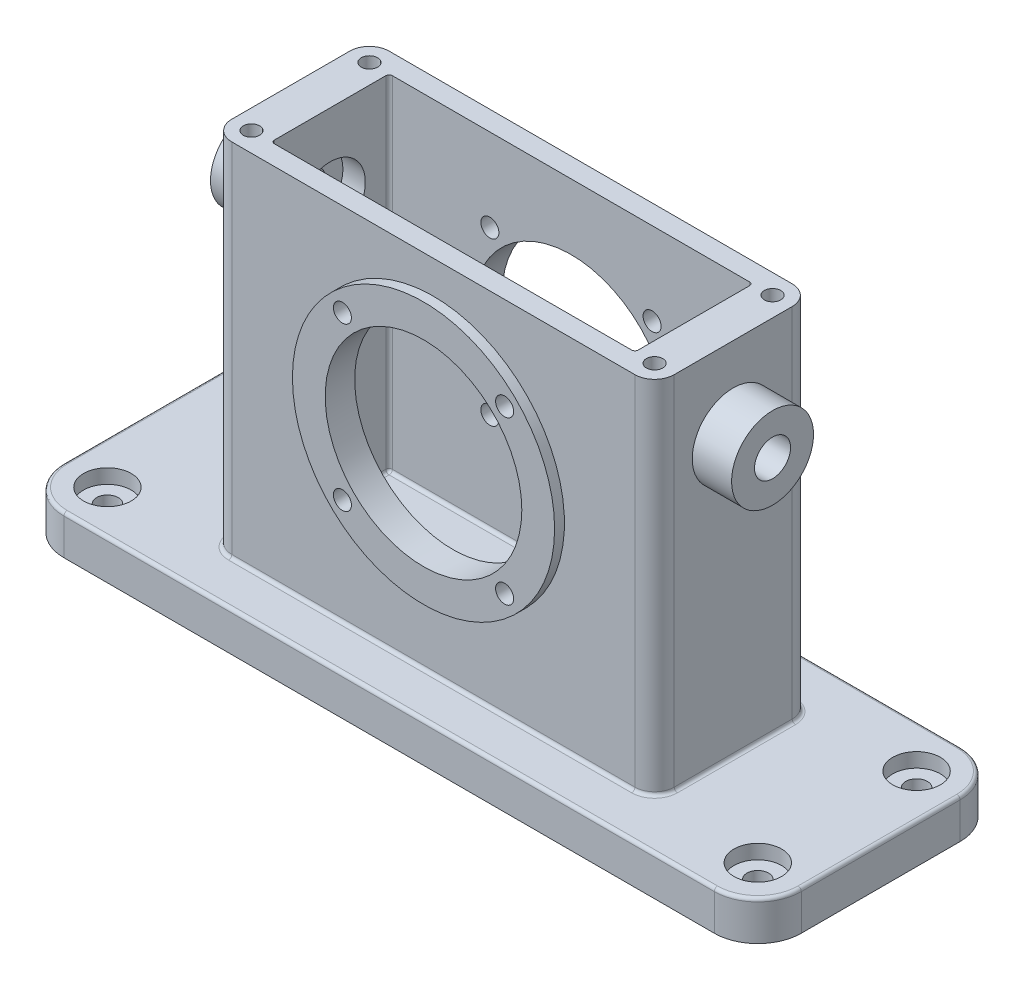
from build123d import *

# Parameters (mm, degrees)
SKETCH1_W                                = 112.5
SKETCH1_H                                = 75
PLATE_DEPTH                              = 12
SKETCH2_W                                = 67.5
SKETCH2_H                                = 48
HSG_DEPTH                                = 110
SKETCH3_R                                = 12.5
SM_CIR_BOSS_DEPTH                        = 12
SKETCH4_W                                = 55.5
SKETCH4_H                                = 36
INNER_CUT_DEPTH                          = 105
CBORE_FOR_M10_HEX_HEAD_BOLT1_D           = 11
CBORE_FOR_M10_HEX_HEAD_BOLT1_CBORE_D     = 21.48
CBORE_FOR_M10_HEX_HEAD_BOLT1_CBORE_DEPTH = 6.85
FILLET1_R                                = 13.275
FILLET2_R                                = 1
FILLET3_R                                = 6
FILLET4_R                                = 1
FILLET5_R                                = 1
FILLET6_R                                = 1
F_5_0_5_DIAMETER_HOLE1_D                 = 5
F_5_0_5_DIAMETER_HOLE1_DEPTH             = 10
F_5_0_5_DIAMETER_HOLE1_TIP               = 1.502151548
CBORE_FOR_M6_HEX_HEAD_BOLT1_D            = 6.6
CBORE_FOR_M6_HEX_HEAD_BOLT1_CBORE_D      = 14.55
CBORE_FOR_M6_HEX_HEAD_BOLT1_CBORE_DEPTH  = 4.38
SKETCH11_R                               = 40
LG_CIR_BOSS_DEPTH                        = 3
SKETCH12_R                               = 30
LG_THRU_HOLE_DEPTH                       = 179.046342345
F_5_5_5_5_DIAMETER_HOLE1_D               = 5.5


with BuildPart() as part:
    # Sketch1 → Plate (new body)
    with BuildSketch(Plane(origin=(0, 0, 0), x_dir=(1, 0, 0), z_dir=(0, 1, 0))):
        with Locations((56.25, 0)):
            Rectangle(SKETCH1_W, SKETCH1_H)
    extrude(amount=PLATE_DEPTH)

    # Sketch2 → Hsg (add)
    with BuildSketch(Plane(origin=(0, 12, 0), x_dir=(1, 0, 0), z_dir=(0, 1, 0))):
        with Locations((33.75, 0)):
            Rectangle(SKETCH2_W, SKETCH2_H)
    extrude(amount=HSG_DEPTH)

    # Sketch3 → Sm Cir Boss (add)
    with BuildSketch(Plane(origin=(67.5, 0, 0), x_dir=(0, 0, -1), z_dir=(1, 0, 0))):
        with Locations(Location((0, 97, 0), (0, 0, 180))):
            Circle(SKETCH3_R)
    extrude(amount=SM_CIR_BOSS_DEPTH)

    # Sketch4 → Inner Cut (cut)
    with BuildSketch(Plane(origin=(0, 122, 0), x_dir=(1, 0, 0), z_dir=(0, 1, 0))):
        with Locations((27.75, 0)):
            Rectangle(SKETCH4_W, SKETCH4_H)
    extrude(amount=-INNER_CUT_DEPTH, mode=Mode.SUBTRACT)

    # CBORE for M10 Hex Head Bolt1 (through all)
    with Locations(Plane.ZY.offset(-55.5)):
        with Locations((0, 97)):
            CounterBoreHole(CBORE_FOR_M10_HEX_HEAD_BOLT1_D / 2, CBORE_FOR_M10_HEX_HEAD_BOLT1_CBORE_D / 2, CBORE_FOR_M10_HEX_HEAD_BOLT1_CBORE_DEPTH)

    # Fillet1
    fillet1_edges = [part.edges().sort_by_distance(p)[0] for p in [
        (112.5, 6, 37.5),
        (112.5, 6, -37.5),
    ]]
    fillet(fillet1_edges, radius=FILLET1_R)

    # Fillet2
    fillet2_edges = [part.edges().sort_by_distance(p)[0] for p in [
        (49.6125, 12, -37.5),
        (108.61184252, 12, -33.61184252),
        (112.5, 12, 0),
        (108.61184252, 12, 33.61184252),
        (49.6125, 12, 37.5),
    ]]
    fillet(fillet2_edges, radius=FILLET2_R)

    # Fillet3
    fillet3_edges = [part.edges().sort_by_distance(p)[0] for p in [
        (67.5, 67, -24),
        (67.5, 67, 24),
    ]]
    fillet(fillet3_edges, radius=FILLET3_R)

    # Fillet4
    fillet4_edges = [part.edges().sort_by_distance(p)[0] for p in [
        (30.75, 12, -24),
        (65.742640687, 12, -22.242640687),
        (67.5, 12, 0),
        (65.742640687, 12, 22.242640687),
        (30.75, 12, 24),
    ]]
    fillet(fillet4_edges, radius=FILLET4_R)

    # Fillet5
    fillet5_edges = [part.edges().sort_by_distance(p)[0] for p in [
        (55.5, 69.5, 18),
        (55.5, 69.5, -18),
    ]]
    fillet(fillet5_edges, radius=FILLET5_R)

    # Fillet6
    fillet6_edges = [part.edges().sort_by_distance(p)[0] for p in [
        (55.5, 17, 0),
        (27.25, 17, -18),
        (55.207106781, 17, -17.707106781),
        (55.207106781, 17, 17.707106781),
        (27.25, 17, 18),
    ]]
    fillet(fillet6_edges, radius=FILLET6_R)

    # 5.0 _5_ Diameter Hole1
    with Locations(Plane(origin=(0, 122, 0), x_dir=(1, 0, 0), z_dir=(0, 1, 0))):
        with Locations((61.5, -18), (61.5, 18)):
            Hole(F_5_0_5_DIAMETER_HOLE1_D / 2, depth=F_5_0_5_DIAMETER_HOLE1_DEPTH)
            with Locations((0, 0, -(F_5_0_5_DIAMETER_HOLE1_DEPTH + F_5_0_5_DIAMETER_HOLE1_TIP / 2))):  # 118° drill point
                Cone(0, F_5_0_5_DIAMETER_HOLE1_D / 2, F_5_0_5_DIAMETER_HOLE1_TIP, mode=Mode.SUBTRACT)

    # CBORE for M6 Hex Head Bolt1 (through all)
    with Locations(Plane(origin=(0, 12, 0), x_dir=(1, 0, 0), z_dir=(0, 1, 0))):
        with Locations((99.225, -24.225), (99.225, 24.225)):
            CounterBoreHole(CBORE_FOR_M6_HEX_HEAD_BOLT1_D / 2, CBORE_FOR_M6_HEX_HEAD_BOLT1_CBORE_D / 2, CBORE_FOR_M6_HEX_HEAD_BOLT1_CBORE_DEPTH)

    # Mirror1: part across plane


with BuildPart() as part_1:
    add(part.part)
    add(part.part.mirror(Plane(origin=(0, 12, -37.5), x_dir=(0, 0, 1), z_dir=(1, 0, 0))))

    # Sketch11 → Lg Cir Boss (add)
    with BuildSketch(Plane.XY.offset(24)):
        with Locations(Location((0, 72, 0), (0, 0, 180))):
            Circle(SKETCH11_R)
    lg_cir_boss = extrude(amount=LG_CIR_BOSS_DEPTH)

    # Mirror2: Lg Cir Boss across plane
    add(lg_cir_boss.mirror(Plane.XY))

    # Sketch12 → Lg Thru Hole (cut, through all)
    with BuildSketch(Plane.XY.offset(27)):
        with Locations(Location((0, 72, 0), (0, 0, 180))):
            Circle(SKETCH12_R)
    extrude(amount=-LG_THRU_HOLE_DEPTH, mode=Mode.SUBTRACT)

    # 5.5 _5.5_ Diameter Hole1 (through all)
    with Locations(Plane.XY.offset(27)):
        with Locations((24.748737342, 96.748737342), (24.748737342, 47.251262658), (-24.748737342, 47.251262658), (-24.748737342, 96.748737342)):
            Hole(F_5_5_5_5_DIAMETER_HOLE1_D / 2)


solid = part_1.part
